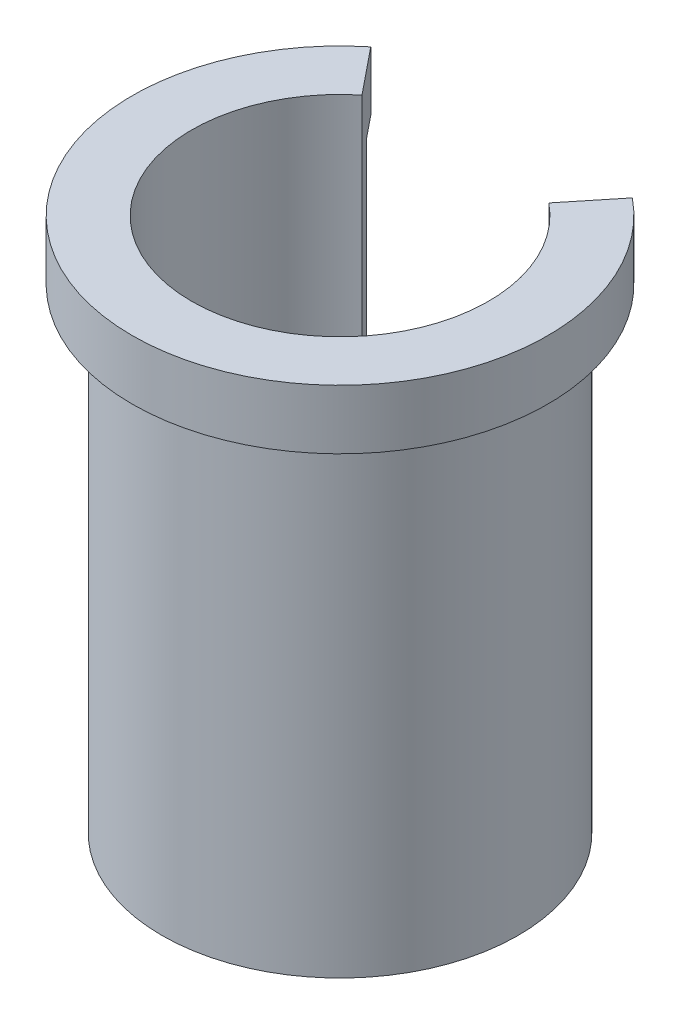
ISO-10303-21;
HEADER;
FILE_DESCRIPTION(('STEP AP214'),'2;1');
FILE_NAME('part.step','',(''),(''),'','','');
FILE_SCHEMA(('AUTOMOTIVE_DESIGN { 1 0 10303 214 1 1 1 1 }'));
ENDSEC;
DATA;
#1=APPLICATION_CONTEXT('core data for automotive mechanical design processes');
#2=APPLICATION_PROTOCOL_DEFINITION('international standard','automotive_design',2000,#1);
#3=PRODUCT_CONTEXT('',#1,'mechanical');
#4=PRODUCT('Part','Part','',(#3));
#5=PRODUCT_RELATED_PRODUCT_CATEGORY('part','',(#4));
#6=PRODUCT_DEFINITION_FORMATION('','',#4);
#7=PRODUCT_DEFINITION_CONTEXT('part definition',#1,'design');
#8=PRODUCT_DEFINITION('design','',#6,#7);
#9=PRODUCT_DEFINITION_SHAPE('','',#8);
#10=(LENGTH_UNIT() NAMED_UNIT(*) SI_UNIT(.MILLI.,.METRE.));
#11=(NAMED_UNIT(*) PLANE_ANGLE_UNIT() SI_UNIT($,.RADIAN.));
#12=(NAMED_UNIT(*) SI_UNIT($,.STERADIAN.) SOLID_ANGLE_UNIT());
#13=UNCERTAINTY_MEASURE_WITH_UNIT(LENGTH_MEASURE(1.E-05),#10,'distance_accuracy_value','');
#14=(GEOMETRIC_REPRESENTATION_CONTEXT(3) GLOBAL_UNCERTAINTY_ASSIGNED_CONTEXT((#13)) GLOBAL_UNIT_ASSIGNED_CONTEXT((#10,
#11,#12)) REPRESENTATION_CONTEXT('',''));
#15=CARTESIAN_POINT('',(0.,0.,0.));
#16=DIRECTION('',(0.,0.,1.));
#17=DIRECTION('',(1.,0.,0.));
#18=AXIS2_PLACEMENT_3D('',#15,#16,#17);
#19=CARTESIAN_POINT('',(0.,18.,0.));
#20=DIRECTION('',(0.,-1.,0.));
#21=DIRECTION('',(0.,0.,-1.));
#22=AXIS2_PLACEMENT_3D('',#19,#20,#21);
#23=CYLINDRICAL_SURFACE('',#22,6.);
#24=CARTESIAN_POINT('',(0.,0.,0.));
#25=DIRECTION('',(0.,1.,0.));
#26=DIRECTION('',(0.,0.,1.));
#27=AXIS2_PLACEMENT_3D('',#24,#25,#26);
#28=CIRCLE('',#27,6.);
#29=CARTESIAN_POINT('',(-3.77592234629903,0.,-4.66287576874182));
#30=VERTEX_POINT('',#29);
#31=CARTESIAN_POINT('',(3.77592234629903,0.,-4.66287576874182));
#32=VERTEX_POINT('',#31);
#33=EDGE_CURVE('E100',#30,#32,#28,.T.);
#34=ORIENTED_EDGE('',*,*,#33,.T.);
#35=DIRECTION('',(0.,-1.,0.));
#36=VECTOR('',#35,1.);
#37=CARTESIAN_POINT('',(3.77592234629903,18.,-4.66287576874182));
#38=LINE('',#37,#36);
#39=CARTESIAN_POINT('',(3.77592234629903,16.,-4.66287576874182));
#40=VERTEX_POINT('',#39);
#41=EDGE_CURVE('E120',#32,#40,#38,.F.);
#42=ORIENTED_EDGE('',*,*,#41,.T.);
#43=CARTESIAN_POINT('',(0.,16.,0.));
#44=DIRECTION('',(0.,1.,0.));
#45=DIRECTION('',(0.,0.,1.));
#46=AXIS2_PLACEMENT_3D('',#43,#44,#45);
#47=CIRCLE('',#46,6.);
#48=CARTESIAN_POINT('',(-3.77592234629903,16.,-4.66287576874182));
#49=VERTEX_POINT('',#48);
#50=EDGE_CURVE('E113',#49,#40,#47,.T.);
#51=ORIENTED_EDGE('',*,*,#50,.F.);
#52=DIRECTION('',(0.,-1.,0.));
#53=VECTOR('',#52,1.);
#54=CARTESIAN_POINT('',(-3.77592234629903,18.,-4.66287576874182));
#55=LINE('',#54,#53);
#56=EDGE_CURVE('E126',#49,#30,#55,.T.);
#57=ORIENTED_EDGE('',*,*,#56,.T.);
#58=EDGE_LOOP('',(#34,#42,#51,#57));
#59=FACE_BOUND('',#58,.T.);
#60=ADVANCED_FACE('F30',(#59),#23,.T.);
#61=CARTESIAN_POINT('',(0.,18.,0.));
#62=DIRECTION('',(0.,1.,0.));
#63=DIRECTION('',(0.,0.,1.));
#64=AXIS2_PLACEMENT_3D('',#61,#62,#63);
#65=PLANE('',#64);
#66=DIRECTION('',(0.629320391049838,0.,-0.77714596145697));
#67=VECTOR('',#66,1.);
#68=CARTESIAN_POINT('',(4.40524273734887,18.,-5.44002173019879));
#69=LINE('',#68,#67);
#70=CARTESIAN_POINT('',(3.14660195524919,18.,-3.88572980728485));
#71=VERTEX_POINT('',#70);
#72=CARTESIAN_POINT('',(4.40524273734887,18.,-5.44002173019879));
#73=VERTEX_POINT('',#72);
#74=EDGE_CURVE('E43',#71,#73,#69,.T.);
#75=ORIENTED_EDGE('',*,*,#74,.F.);
#76=CARTESIAN_POINT('',(0.,18.,0.));
#77=DIRECTION('',(0.,1.,0.));
#78=DIRECTION('',(0.,0.,1.));
#79=AXIS2_PLACEMENT_3D('',#76,#77,#78);
#80=CIRCLE('',#79,5.);
#81=CARTESIAN_POINT('',(-3.14660195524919,18.,-3.88572980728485));
#82=VERTEX_POINT('',#81);
#83=EDGE_CURVE('E104',#82,#71,#80,.T.);
#84=ORIENTED_EDGE('',*,*,#83,.F.);
#85=DIRECTION('',(0.629320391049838,0.,0.77714596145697));
#86=VECTOR('',#85,1.);
#87=CARTESIAN_POINT('',(-4.40524273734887,18.,-5.44002173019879));
#88=LINE('',#87,#86);
#89=CARTESIAN_POINT('',(-4.40524273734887,18.,-5.44002173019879));
#90=VERTEX_POINT('',#89);
#91=EDGE_CURVE('E85',#90,#82,#88,.T.);
#92=ORIENTED_EDGE('',*,*,#91,.F.);
#93=CARTESIAN_POINT('',(0.,18.,0.));
#94=DIRECTION('',(0.,1.,0.));
#95=DIRECTION('',(0.,0.,1.));
#96=AXIS2_PLACEMENT_3D('',#93,#94,#95);
#97=CIRCLE('',#96,7.);
#98=EDGE_CURVE('E109',#90,#73,#97,.T.);
#99=ORIENTED_EDGE('',*,*,#98,.T.);
#100=EDGE_LOOP('',(#75,#84,#92,#99));
#101=FACE_BOUND('',#100,.T.);
#102=ADVANCED_FACE('F139',(#101),#65,.T.);
#103=CARTESIAN_POINT('',(0.,0.,0.));
#104=DIRECTION('',(0.,1.,0.));
#105=DIRECTION('',(0.,0.,1.));
#106=AXIS2_PLACEMENT_3D('',#103,#104,#105);
#107=PLANE('',#106);
#108=CARTESIAN_POINT('',(0.,0.,0.));
#109=DIRECTION('',(0.,1.,0.));
#110=DIRECTION('',(0.,0.,1.));
#111=AXIS2_PLACEMENT_3D('',#108,#109,#110);
#112=CIRCLE('',#111,5.);
#113=CARTESIAN_POINT('',(-3.14660195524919,0.,-3.88572980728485));
#114=VERTEX_POINT('',#113);
#115=CARTESIAN_POINT('',(3.14660195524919,0.,-3.88572980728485));
#116=VERTEX_POINT('',#115);
#117=EDGE_CURVE('E98',#114,#116,#112,.T.);
#118=ORIENTED_EDGE('',*,*,#117,.T.);
#119=DIRECTION('',(0.629320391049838,0.,-0.77714596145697));
#120=VECTOR('',#119,1.);
#121=CARTESIAN_POINT('',(4.40524273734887,0.,-5.44002173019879));
#122=LINE('',#121,#120);
#123=EDGE_CURVE('E91',#116,#32,#122,.T.);
#124=ORIENTED_EDGE('',*,*,#123,.T.);
#125=ORIENTED_EDGE('',*,*,#33,.F.);
#126=DIRECTION('',(0.629320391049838,0.,0.77714596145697));
#127=VECTOR('',#126,1.);
#128=CARTESIAN_POINT('',(-4.40524273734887,0.,-5.44002173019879));
#129=LINE('',#128,#127);
#130=EDGE_CURVE('E82',#30,#114,#129,.T.);
#131=ORIENTED_EDGE('',*,*,#130,.T.);
#132=EDGE_LOOP('',(#118,#124,#125,#131));
#133=FACE_BOUND('',#132,.T.);
#134=ADVANCED_FACE('F96',(#133),#107,.F.);
#135=CARTESIAN_POINT('',(0.,18.,0.));
#136=DIRECTION('',(0.,-1.,0.));
#137=DIRECTION('',(0.,0.,-1.));
#138=AXIS2_PLACEMENT_3D('',#135,#136,#137);
#139=CYLINDRICAL_SURFACE('',#138,5.);
#140=DIRECTION('',(0.,1.,0.));
#141=VECTOR('',#140,1.);
#142=CARTESIAN_POINT('',(3.14660195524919,0.,-3.88572980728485));
#143=LINE('',#142,#141);
#144=EDGE_CURVE('E90',#116,#71,#143,.T.);
#145=ORIENTED_EDGE('',*,*,#144,.F.);
#146=ORIENTED_EDGE('',*,*,#117,.F.);
#147=DIRECTION('',(0.,1.,0.));
#148=VECTOR('',#147,1.);
#149=CARTESIAN_POINT('',(-3.14660195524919,0.,-3.88572980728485));
#150=LINE('',#149,#148);
#151=EDGE_CURVE('E79',#114,#82,#150,.T.);
#152=ORIENTED_EDGE('',*,*,#151,.T.);
#153=ORIENTED_EDGE('',*,*,#83,.T.);
#154=EDGE_LOOP('',(#145,#146,#152,#153));
#155=FACE_BOUND('',#154,.T.);
#156=ADVANCED_FACE('F103',(#155),#139,.F.);
#157=CARTESIAN_POINT('',(0.,16.,0.));
#158=DIRECTION('',(0.,1.,0.));
#159=DIRECTION('',(0.,0.,1.));
#160=AXIS2_PLACEMENT_3D('',#157,#158,#159);
#161=PLANE('',#160);
#162=ORIENTED_EDGE('',*,*,#50,.T.);
#163=DIRECTION('',(0.629320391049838,0.,-0.77714596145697));
#164=VECTOR('',#163,1.);
#165=CARTESIAN_POINT('',(0.,16.,0.));
#166=LINE('',#165,#164);
#167=CARTESIAN_POINT('',(4.40524273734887,16.,-5.44002173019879));
#168=VERTEX_POINT('',#167);
#169=EDGE_CURVE('E124',#40,#168,#166,.T.);
#170=ORIENTED_EDGE('',*,*,#169,.T.);
#171=CARTESIAN_POINT('',(0.,16.,0.));
#172=DIRECTION('',(0.,1.,0.));
#173=DIRECTION('',(0.,0.,1.));
#174=AXIS2_PLACEMENT_3D('',#171,#172,#173);
#175=CIRCLE('',#174,7.);
#176=CARTESIAN_POINT('',(-4.40524273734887,16.,-5.44002173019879));
#177=VERTEX_POINT('',#176);
#178=EDGE_CURVE('E105',#177,#168,#175,.T.);
#179=ORIENTED_EDGE('',*,*,#178,.F.);
#180=DIRECTION('',(0.629320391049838,0.,0.77714596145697));
#181=VECTOR('',#180,1.);
#182=CARTESIAN_POINT('',(0.,16.,0.));
#183=LINE('',#182,#181);
#184=EDGE_CURVE('E51',#177,#49,#183,.T.);
#185=ORIENTED_EDGE('',*,*,#184,.T.);
#186=EDGE_LOOP('',(#162,#170,#179,#185));
#187=FACE_BOUND('',#186,.T.);
#188=ADVANCED_FACE('F134',(#187),#161,.F.);
#189=CARTESIAN_POINT('',(0.,16.,0.));
#190=DIRECTION('',(0.,1.,0.));
#191=DIRECTION('',(0.,0.,1.));
#192=AXIS2_PLACEMENT_3D('',#189,#190,#191);
#193=CYLINDRICAL_SURFACE('',#192,7.);
#194=DIRECTION('',(0.,1.,0.));
#195=VECTOR('',#194,1.);
#196=CARTESIAN_POINT('',(4.40524273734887,16.,-5.44002173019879));
#197=LINE('',#196,#195);
#198=EDGE_CURVE('E11',#73,#168,#197,.F.);
#199=ORIENTED_EDGE('',*,*,#198,.F.);
#200=ORIENTED_EDGE('',*,*,#98,.F.);
#201=DIRECTION('',(0.,1.,0.));
#202=VECTOR('',#201,1.);
#203=CARTESIAN_POINT('',(-4.40524273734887,16.,-5.44002173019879));
#204=LINE('',#203,#202);
#205=EDGE_CURVE('E37',#177,#90,#204,.T.);
#206=ORIENTED_EDGE('',*,*,#205,.F.);
#207=ORIENTED_EDGE('',*,*,#178,.T.);
#208=EDGE_LOOP('',(#199,#200,#206,#207));
#209=FACE_BOUND('',#208,.T.);
#210=ADVANCED_FACE('F136',(#209),#193,.T.);
#211=CARTESIAN_POINT('',(-4.40524273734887,0.,-5.44002173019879));
#212=DIRECTION('',(-0.77714596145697,0.,0.629320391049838));
#213=DIRECTION('',(0.629320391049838,0.,0.77714596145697));
#214=AXIS2_PLACEMENT_3D('',#211,#212,#213);
#215=PLANE('',#214);
#216=ORIENTED_EDGE('',*,*,#184,.F.);
#217=ORIENTED_EDGE('',*,*,#205,.T.);
#218=ORIENTED_EDGE('',*,*,#91,.T.);
#219=ORIENTED_EDGE('',*,*,#151,.F.);
#220=ORIENTED_EDGE('',*,*,#130,.F.);
#221=ORIENTED_EDGE('',*,*,#56,.F.);
#222=EDGE_LOOP('',(#216,#217,#218,#219,#220,#221));
#223=FACE_BOUND('',#222,.T.);
#224=ADVANCED_FACE('F81',(#223),#215,.F.);
#225=CARTESIAN_POINT('',(4.40524273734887,0.,-5.44002173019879));
#226=DIRECTION('',(0.77714596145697,0.,0.629320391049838));
#227=DIRECTION('',(0.629320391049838,0.,-0.77714596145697));
#228=AXIS2_PLACEMENT_3D('',#225,#226,#227);
#229=PLANE('',#228);
#230=ORIENTED_EDGE('',*,*,#123,.F.);
#231=ORIENTED_EDGE('',*,*,#144,.T.);
#232=ORIENTED_EDGE('',*,*,#74,.T.);
#233=ORIENTED_EDGE('',*,*,#198,.T.);
#234=ORIENTED_EDGE('',*,*,#169,.F.);
#235=ORIENTED_EDGE('',*,*,#41,.F.);
#236=EDGE_LOOP('',(#230,#231,#232,#233,#234,#235));
#237=FACE_BOUND('',#236,.T.);
#238=ADVANCED_FACE('F155',(#237),#229,.F.);
#239=CLOSED_SHELL('',(#60,#102,#134,#156,#188,#210,#224,#238));
#240=MANIFOLD_SOLID_BREP('B2',#239);
#241=ADVANCED_BREP_SHAPE_REPRESENTATION('',(#18,#240),#14);
#242=SHAPE_DEFINITION_REPRESENTATION(#9,#241);
ENDSEC;
END-ISO-10303-21;
